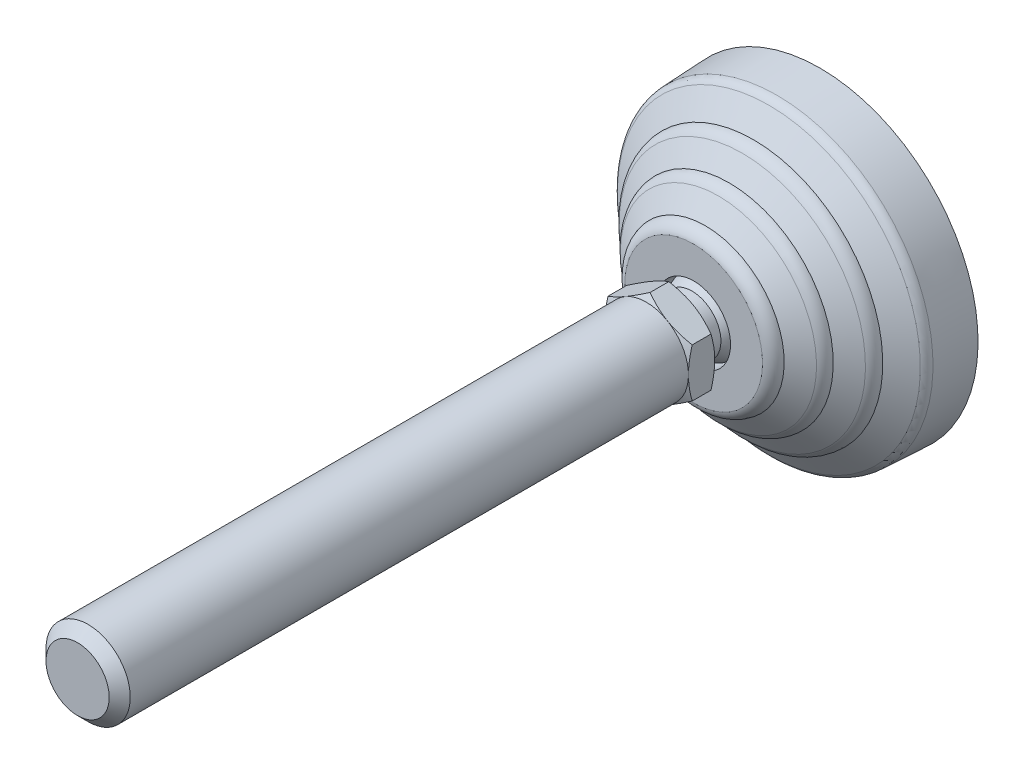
ISO-10303-21;
HEADER;
FILE_DESCRIPTION(('STEP AP214'),'2;1');
FILE_NAME('part.step','',(''),(''),'','','');
FILE_SCHEMA(('AUTOMOTIVE_DESIGN { 1 0 10303 214 1 1 1 1 }'));
ENDSEC;
DATA;
#1=APPLICATION_CONTEXT('core data for automotive mechanical design processes');
#2=APPLICATION_PROTOCOL_DEFINITION('international standard','automotive_design',2000,#1);
#3=PRODUCT_CONTEXT('',#1,'mechanical');
#4=PRODUCT('Part','Part','',(#3));
#5=PRODUCT_RELATED_PRODUCT_CATEGORY('part','',(#4));
#6=PRODUCT_DEFINITION_FORMATION('','',#4);
#7=PRODUCT_DEFINITION_CONTEXT('part definition',#1,'design');
#8=PRODUCT_DEFINITION('design','',#6,#7);
#9=PRODUCT_DEFINITION_SHAPE('','',#8);
#10=(LENGTH_UNIT() NAMED_UNIT(*) SI_UNIT(.MILLI.,.METRE.));
#11=(NAMED_UNIT(*) PLANE_ANGLE_UNIT() SI_UNIT($,.RADIAN.));
#12=(NAMED_UNIT(*) SI_UNIT($,.STERADIAN.) SOLID_ANGLE_UNIT());
#13=UNCERTAINTY_MEASURE_WITH_UNIT(LENGTH_MEASURE(1.E-05),#10,'distance_accuracy_value','');
#14=(GEOMETRIC_REPRESENTATION_CONTEXT(3) GLOBAL_UNCERTAINTY_ASSIGNED_CONTEXT((#13)) GLOBAL_UNIT_ASSIGNED_CONTEXT((#10,
#11,#12)) REPRESENTATION_CONTEXT('',''));
#15=CARTESIAN_POINT('',(0.,0.,0.));
#16=DIRECTION('',(0.,0.,1.));
#17=DIRECTION('',(1.,0.,0.));
#18=AXIS2_PLACEMENT_3D('',#15,#16,#17);
#19=CARTESIAN_POINT('',(0.,0.,85.773));
#20=DIRECTION('',(0.,0.,-1.));
#21=DIRECTION('',(0.,1.,0.));
#22=AXIS2_PLACEMENT_3D('',#19,#20,#21);
#23=CYLINDRICAL_SURFACE('',#22,8.);
#24=CARTESIAN_POINT('',(0.,0.,139.));
#25=DIRECTION('',(0.,0.,1.));
#26=DIRECTION('',(0.,-1.,0.));
#27=AXIS2_PLACEMENT_3D('',#24,#25,#26);
#28=CIRCLE('',#27,8.);
#29=CARTESIAN_POINT('',(0.,-8.,139.));
#30=VERTEX_POINT('',#29);
#31=EDGE_CURVE('E9',#30,#30,#28,.F.);
#32=ORIENTED_EDGE('',*,*,#31,.T.);
#33=EDGE_LOOP('',(#32));
#34=FACE_BOUND('',#33,.T.);
#35=CARTESIAN_POINT('',(0.,0.,33.));
#36=DIRECTION('',(0.,0.,-1.));
#37=DIRECTION('',(0.,1.,0.));
#38=AXIS2_PLACEMENT_3D('',#35,#36,#37);
#39=CIRCLE('',#38,8.);
#40=CARTESIAN_POINT('',(0.,8.,33.));
#41=VERTEX_POINT('',#40);
#42=EDGE_CURVE('E124',#41,#41,#39,.F.);
#43=ORIENTED_EDGE('',*,*,#42,.T.);
#44=EDGE_LOOP('',(#43));
#45=FACE_BOUND('',#44,.T.);
#46=ADVANCED_FACE('F14',(#34,#45),#23,.T.);
#47=CARTESIAN_POINT('',(7.995,0.,33.));
#48=DIRECTION('',(0.,0.,-1.));
#49=DIRECTION('',(0.,1.,0.));
#50=AXIS2_PLACEMENT_3D('',#47,#48,#49);
#51=PLANE('',#50);
#52=CARTESIAN_POINT('',(0.,0.,33.));
#53=DIRECTION('',(0.,0.,-1.));
#54=DIRECTION('',(0.,1.,0.));
#55=AXIS2_PLACEMENT_3D('',#52,#53,#54);
#56=CIRCLE('',#55,7.99);
#57=CARTESIAN_POINT('',(0.,7.99,33.));
#58=VERTEX_POINT('',#57);
#59=EDGE_CURVE('E132',#58,#58,#56,.F.);
#60=ORIENTED_EDGE('',*,*,#59,.T.);
#61=EDGE_LOOP('',(#60));
#62=FACE_BOUND('',#61,.T.);
#63=ORIENTED_EDGE('',*,*,#42,.F.);
#64=EDGE_LOOP('',(#63));
#65=FACE_BOUND('',#64,.T.);
#66=ADVANCED_FACE('F157',(#62,#65),#51,.T.);
#67=CARTESIAN_POINT('',(0.,0.,32.2753734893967));
#68=DIRECTION('',(0.,0.,-1.));
#69=DIRECTION('',(0.,1.,0.));
#70=AXIS2_PLACEMENT_3D('',#67,#68,#69);
#71=CONICAL_SURFACE('',#70,9.2450899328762,1.0471975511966);
#72=ORIENTED_EDGE('',*,*,#59,.F.);
#73=EDGE_LOOP('',(#72));
#74=FACE_BOUND('',#73,.T.);
#75=CARTESIAN_POINT('',(-4.19327851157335E-08,-9.23760428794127,32.2796952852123));
#76=CARTESIAN_POINT('',(0.175847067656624,-9.13607893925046,32.3382996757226));
#77=CARTESIAN_POINT('',(0.352349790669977,-9.03417505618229,32.3942441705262));
#78=CARTESIAN_POINT('',(0.706788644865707,-8.82953969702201,32.5000807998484));
#79=CARTESIAN_POINT('',(0.884725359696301,-8.72680788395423,32.5499703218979));
#80=CARTESIAN_POINT('',(1.42138431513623,-8.41696768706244,32.6895770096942));
#81=CARTESIAN_POINT('',(1.78222493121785,-8.20863626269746,32.7689823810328));
#82=CARTESIAN_POINT('',(2.32221590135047,-7.896872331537,32.862092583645));
#83=CARTESIAN_POINT('',(2.49975318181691,-7.79437113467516,32.8886165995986));
#84=CARTESIAN_POINT('',(2.85563052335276,-7.58890525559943,32.9330919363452));
#85=CARTESIAN_POINT('',(3.03397051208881,-7.48594061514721,32.9510440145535));
#86=CARTESIAN_POINT('',(3.3909574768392,-7.27983409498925,32.9779205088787));
#87=CARTESIAN_POINT('',(3.56960387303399,-7.17669255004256,32.9868551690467));
#88=CARTESIAN_POINT('',(3.92706158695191,-6.97031424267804,32.9955052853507));
#89=CARTESIAN_POINT('',(4.10587289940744,-6.86707748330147,32.995221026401));
#90=CARTESIAN_POINT('',(4.44015430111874,-6.67408002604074,32.9860752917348));
#91=CARTESIAN_POINT('',(4.59564800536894,-6.58430569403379,32.9783294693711));
#92=CARTESIAN_POINT('',(4.90627121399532,-6.4049673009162,32.956016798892));
#93=CARTESIAN_POINT('',(5.06140069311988,-6.31540325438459,32.9414494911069));
#94=CARTESIAN_POINT('',(5.52618852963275,-6.04705787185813,32.8878596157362));
#95=CARTESIAN_POINT('',(5.83502420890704,-5.86875150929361,32.8389557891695));
#96=CARTESIAN_POINT('',(6.45597113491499,-5.51024763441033,32.7166979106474));
#97=CARTESIAN_POINT('',(6.76800315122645,-5.33009586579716,32.6428257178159));
#98=CARTESIAN_POINT('',(7.38741452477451,-4.97247854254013,32.4751673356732));
#99=CARTESIAN_POINT('',(7.69480181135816,-4.79500840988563,32.3814205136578));
#100=CARTESIAN_POINT('',(7.9999999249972,-4.6188021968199,32.2796953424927));
#101=B_SPLINE_CURVE_WITH_KNOTS('',3,(#75,#76,#77,#78,#79,#80,#81,#82,#83,#84,#85,#86,#87,#88,
#89,#90,#91,#92,#93,#94,#95,#96,#97,#98,#99,#100),.UNSPECIFIED.,.F.,.F.,(4,2,2,2,2,2,2,2,2,2,2,
2,4),(0.,0.633965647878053,1.26820386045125,2.53931509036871,3.15930425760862,3.77923863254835,
4.39846794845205,5.01767812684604,5.55669080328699,6.09573980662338,7.17460542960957,
8.2773951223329,9.37802050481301),.UNSPECIFIED.);
#102=CARTESIAN_POINT('',(-1.44240227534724E-08,-9.23760431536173,32.2796953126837));
#103=VERTEX_POINT('',#102);
#104=CARTESIAN_POINT('',(8.,-4.61880217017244,32.2796953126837));
#105=VERTEX_POINT('',#104);
#106=EDGE_CURVE('E143',#103,#105,#101,.T.);
#107=ORIENTED_EDGE('',*,*,#106,.T.);
#108=CARTESIAN_POINT('',(7.9999999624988,-4.6188021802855,32.2796952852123));
#109=CARTESIAN_POINT('',(7.99999998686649,-4.23969380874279,32.3891659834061));
#110=CARTESIAN_POINT('',(7.999999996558,-3.85751175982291,32.4893813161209));
#111=CARTESIAN_POINT('',(8.00000000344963,-3.08693961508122,32.6664987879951));
#112=CARTESIAN_POINT('',(8.00000000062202,-2.69853763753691,32.7433487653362));
#113=CARTESIAN_POINT('',(7.99999999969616,-2.11699996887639,32.8364192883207));
#114=CARTESIAN_POINT('',(7.99999999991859,-1.92560834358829,32.8635449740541));
#115=CARTESIAN_POINT('',(8.0000000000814,-1.54193621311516,32.9104602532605));
#116=CARTESIAN_POINT('',(8.0000000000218,-1.34965578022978,32.9302504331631));
#117=CARTESIAN_POINT('',(7.99999999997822,-0.96464588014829,32.962068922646));
#118=CARTESIAN_POINT('',(7.99999999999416,-0.771917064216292,32.9741050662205));
#119=CARTESIAN_POINT('',(8.00000000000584,-0.386125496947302,32.9901838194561));
#120=CARTESIAN_POINT('',(8.00000000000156,-0.193062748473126,32.9942264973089));
#121=CARTESIAN_POINT('',(7.99999999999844,0.193062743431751,32.9942264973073));
#122=CARTESIAN_POINT('',(7.99999999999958,0.386125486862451,32.990183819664));
#123=CARTESIAN_POINT('',(8.00000000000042,0.771917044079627,32.9741050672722));
#124=CARTESIAN_POINT('',(8.00000000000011,0.96464585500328,32.962068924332));
#125=CARTESIAN_POINT('',(7.99999999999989,1.34965574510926,32.930250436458));
#126=CARTESIAN_POINT('',(7.99999999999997,1.54193617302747,32.9104602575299));
#127=CARTESIAN_POINT('',(8.00000000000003,1.92560829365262,32.8635449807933));
#128=CARTESIAN_POINT('',(8.00000000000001,2.11699991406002,32.8364192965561));
#129=CARTESIAN_POINT('',(7.99999999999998,2.69853756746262,32.7433487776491));
#130=CARTESIAN_POINT('',(7.99999999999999,3.0869395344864,32.6664988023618));
#131=CARTESIAN_POINT('',(8.00000000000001,3.85751166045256,32.4893813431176));
#132=CARTESIAN_POINT('',(8.00000000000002,4.23969370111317,32.3891660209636));
#133=CARTESIAN_POINT('',(8.,4.61880206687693,32.2796953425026));
#134=B_SPLINE_CURVE_WITH_KNOTS('',3,(#108,#109,#110,#111,#112,#113,#114,#115,#116,#117,#118,
#119,#120,#121,#122,#123,#124,#125,#126,#127,#128,#129,#130,#131,#132,#133),.UNSPECIFIED.,.F.,
.F.,(4,2,2,2,2,2,2,2,2,2,2,2,4),(0.,1.1842935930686,2.37121196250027,2.95099639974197,
3.53073447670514,4.10988591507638,4.68903241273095,5.26817889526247,5.84733031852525,
6.42706838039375,7.00685280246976,8.19377114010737,9.37806470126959),.UNSPECIFIED.);
#135=CARTESIAN_POINT('',(8.00000001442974,4.618802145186,32.2796953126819));
#136=VERTEX_POINT('',#135);
#137=EDGE_CURVE('E135',#105,#136,#134,.T.);
#138=ORIENTED_EDGE('',*,*,#137,.T.);
#139=CARTESIAN_POINT('',(8.00000000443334,4.61880210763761,32.2796952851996));
#140=CARTESIAN_POINT('',(7.82415291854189,4.72032749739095,32.3382996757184));
#141=CARTESIAN_POINT('',(7.64765020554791,4.8222313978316,32.3942441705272));
#142=CARTESIAN_POINT('',(7.29321135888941,5.02686677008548,32.500080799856));
#143=CARTESIAN_POINT('',(7.11527464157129,5.12959857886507,32.549970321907));
#144=CARTESIAN_POINT('',(6.57861568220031,5.43943876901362,32.689577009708));
#145=CARTESIAN_POINT('',(6.21777506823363,5.6477701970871,32.7689823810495));
#146=CARTESIAN_POINT('',(5.67778409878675,5.95953412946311,32.8620925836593));
#147=CARTESIAN_POINT('',(5.50024681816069,6.06203532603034,32.8886165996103));
#148=CARTESIAN_POINT('',(5.14436947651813,6.2675012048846,32.9330919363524));
#149=CARTESIAN_POINT('',(4.96602948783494,6.37046584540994,32.9510440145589));
#150=CARTESIAN_POINT('',(4.60904252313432,6.57657236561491,32.977920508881));
#151=CARTESIAN_POINT('',(4.43039612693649,6.6797139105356,32.986855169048));
#152=CARTESIAN_POINT('',(4.0729384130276,6.88609221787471,32.9955052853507));
#153=CARTESIAN_POINT('',(3.89412710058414,6.98932897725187,32.9952210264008));
#154=CARTESIAN_POINT('',(3.55984569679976,7.18232643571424,32.9860752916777));
#155=CARTESIAN_POINT('',(3.40435199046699,7.27210076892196,32.9783294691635));
#156=CARTESIAN_POINT('',(3.09372877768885,7.45143916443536,32.9560167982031));
#157=CARTESIAN_POINT('',(2.93859929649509,7.54100321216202,32.9414494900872));
#158=CARTESIAN_POINT('',(2.47381145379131,7.80934859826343,32.8878596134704));
#159=CARTESIAN_POINT('',(2.16497577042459,7.98765496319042,32.8389557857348));
#160=CARTESIAN_POINT('',(1.54402883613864,8.34615884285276,32.7166979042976));
#161=CARTESIAN_POINT('',(1.23199681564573,8.52631061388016,32.6428257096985));
#162=CARTESIAN_POINT('',(0.612585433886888,8.8839279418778,32.4751673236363));
#163=CARTESIAN_POINT('',(0.305198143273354,9.06139807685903,32.3814204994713));
#164=CARTESIAN_POINT('',(2.56600579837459E-08,9.23760429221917,32.2796953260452));
#165=B_SPLINE_CURVE_WITH_KNOTS('',3,(#139,#140,#141,#142,#143,#144,#145,#146,#147,#148,#149,
#150,#151,#152,#153,#154,#155,#156,#157,#158,#159,#160,#161,#162,#163,#164),.UNSPECIFIED.,.F.,
.F.,(4,2,2,2,2,2,2,2,2,2,2,2,4),(0.,0.633965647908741,1.26820386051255,2.53931509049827,
3.15930425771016,3.77923863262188,4.39846794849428,5.01767812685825,5.55669081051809,
6.09573982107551,7.1746054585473,8.27739516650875,9.37802056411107),.UNSPECIFIED.);
#166=CARTESIAN_POINT('',(-1.15386855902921E-08,9.23760430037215,32.279695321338));
#167=VERTEX_POINT('',#166);
#168=EDGE_CURVE('E181',#136,#167,#165,.T.);
#169=ORIENTED_EDGE('',*,*,#168,.T.);
#170=CARTESIAN_POINT('',(-1.65350876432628E-08,9.23760427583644,32.2796953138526));
#171=CARTESIAN_POINT('',(-0.175847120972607,9.13607891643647,32.3382996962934));
#172=CARTESIAN_POINT('',(-0.352349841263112,9.03417502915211,32.3942441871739));
#173=CARTESIAN_POINT('',(-0.706788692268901,8.82953966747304,32.5000808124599));
#174=CARTESIAN_POINT('',(-0.884725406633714,8.72680785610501,32.5499703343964));
#175=CARTESIAN_POINT('',(-1.42138436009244,8.41696766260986,32.6895770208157));
#176=CARTESIAN_POINT('',(-1.78222497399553,8.20863623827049,32.7689823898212));
#177=CARTESIAN_POINT('',(-2.32221594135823,7.89687230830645,32.8620925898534));
#178=CARTESIAN_POINT('',(-2.4997532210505,7.79437111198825,32.8886166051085));
#179=CARTESIAN_POINT('',(-2.85563056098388,7.58890523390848,32.9330919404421));
#180=CARTESIAN_POINT('',(-3.03397054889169,7.48594059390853,32.9510440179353));
#181=CARTESIAN_POINT('',(-3.39095751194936,7.27983407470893,32.9779205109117));
#182=CARTESIAN_POINT('',(-3.56960390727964,7.1766925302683,32.9868551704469));
#183=CARTESIAN_POINT('',(-3.92706161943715,6.97031422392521,32.9955052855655));
#184=CARTESIAN_POINT('',(-4.10587293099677,6.867077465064,32.9952210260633));
#185=CARTESIAN_POINT('',(-4.44015433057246,6.67408000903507,32.9860752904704));
#186=CARTESIAN_POINT('',(-4.59564803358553,6.58430567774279,32.9783294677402));
#187=CARTESIAN_POINT('',(-4.90627123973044,6.40496728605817,32.9560167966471));
#188=CARTESIAN_POINT('',(-5.06140071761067,6.31540324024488,32.9414494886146));
#189=CARTESIAN_POINT('',(-5.52618855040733,6.04705785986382,32.8878596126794));
#190=CARTESIAN_POINT('',(-5.83502422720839,5.8687514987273,32.8389557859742));
#191=CARTESIAN_POINT('',(-6.45597114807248,5.51024762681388,32.7166979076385));
#192=CARTESIAN_POINT('',(-6.76800316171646,5.33009585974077,32.6428257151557));
#193=CARTESIAN_POINT('',(-7.38741452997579,4.97247853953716,32.4751673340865));
#194=CARTESIAN_POINT('',(-7.69480181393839,4.7950084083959,32.381420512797));
#195=CARTESIAN_POINT('',(-7.9999999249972,4.6188021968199,32.2796953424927));
#196=B_SPLINE_CURVE_WITH_KNOTS('',3,(#170,#171,#172,#173,#174,#175,#176,#177,#178,#179,#180,
#181,#182,#183,#184,#185,#186,#187,#188,#189,#190,#191,#192,#193,#194,#195),.UNSPECIFIED.,.F.,
.F.,(4,2,2,2,2,2,2,2,2,2,2,2,4),(0.,0.633965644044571,1.26820385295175,2.5393150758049,
3.15930423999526,3.77923861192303,4.39846792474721,5.01767810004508,5.55669077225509,
6.09573977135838,7.17460538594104,8.27739506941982,9.37802044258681),.UNSPECIFIED.);
#197=CARTESIAN_POINT('',(-8.,4.61880217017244,32.2796953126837));
#198=VERTEX_POINT('',#197);
#199=EDGE_CURVE('E173',#167,#198,#196,.T.);
#200=ORIENTED_EDGE('',*,*,#199,.T.);
#201=CARTESIAN_POINT('',(-7.9999999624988,4.6188021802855,32.2796952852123));
#202=CARTESIAN_POINT('',(-7.99999998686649,4.23969380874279,32.3891659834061));
#203=CARTESIAN_POINT('',(-7.999999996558,3.85751175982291,32.4893813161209));
#204=CARTESIAN_POINT('',(-8.00000000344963,3.08693961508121,32.6664987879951));
#205=CARTESIAN_POINT('',(-8.00000000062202,2.69853763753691,32.7433487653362));
#206=CARTESIAN_POINT('',(-7.99999999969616,2.11699996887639,32.8364192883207));
#207=CARTESIAN_POINT('',(-7.99999999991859,1.92560834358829,32.8635449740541));
#208=CARTESIAN_POINT('',(-8.0000000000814,1.54193621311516,32.9104602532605));
#209=CARTESIAN_POINT('',(-8.0000000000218,1.34965578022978,32.9302504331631));
#210=CARTESIAN_POINT('',(-7.99999999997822,0.964645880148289,32.962068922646));
#211=CARTESIAN_POINT('',(-7.99999999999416,0.77191706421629,32.9741050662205));
#212=CARTESIAN_POINT('',(-8.00000000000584,0.386125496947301,32.9901838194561));
#213=CARTESIAN_POINT('',(-8.00000000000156,0.193062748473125,32.9942264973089));
#214=CARTESIAN_POINT('',(-7.99999999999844,-0.193062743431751,32.9942264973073));
#215=CARTESIAN_POINT('',(-7.99999999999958,-0.386125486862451,32.990183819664));
#216=CARTESIAN_POINT('',(-8.00000000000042,-0.771917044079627,32.9741050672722));
#217=CARTESIAN_POINT('',(-8.00000000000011,-0.96464585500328,32.962068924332));
#218=CARTESIAN_POINT('',(-7.99999999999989,-1.34965574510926,32.930250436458));
#219=CARTESIAN_POINT('',(-7.99999999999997,-1.54193617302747,32.9104602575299));
#220=CARTESIAN_POINT('',(-8.00000000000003,-1.92560829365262,32.8635449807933));
#221=CARTESIAN_POINT('',(-8.00000000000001,-2.11699991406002,32.8364192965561));
#222=CARTESIAN_POINT('',(-7.99999999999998,-2.69853756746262,32.7433487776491));
#223=CARTESIAN_POINT('',(-7.99999999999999,-3.0869395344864,32.6664988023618));
#224=CARTESIAN_POINT('',(-8.00000000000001,-3.85751166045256,32.4893813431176));
#225=CARTESIAN_POINT('',(-8.00000000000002,-4.23969370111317,32.3891660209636));
#226=CARTESIAN_POINT('',(-8.,-4.61880206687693,32.2796953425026));
#227=B_SPLINE_CURVE_WITH_KNOTS('',3,(#201,#202,#203,#204,#205,#206,#207,#208,#209,#210,#211,
#212,#213,#214,#215,#216,#217,#218,#219,#220,#221,#222,#223,#224,#225,#226),.UNSPECIFIED.,.F.,
.F.,(4,2,2,2,2,2,2,2,2,2,2,2,4),(0.,1.18429359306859,2.37121196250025,2.95099639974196,
3.53073447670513,4.10988591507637,4.68903241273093,5.26817889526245,5.84733031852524,
6.42706838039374,7.00685280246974,8.19377114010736,9.37806470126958),.UNSPECIFIED.);
#228=CARTESIAN_POINT('',(-8.00000001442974,-4.61880214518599,32.2796953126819));
#229=VERTEX_POINT('',#228);
#230=EDGE_CURVE('E342',#198,#229,#227,.T.);
#231=ORIENTED_EDGE('',*,*,#230,.T.);
#232=CARTESIAN_POINT('',(-8.00000000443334,-4.61880210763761,32.2796952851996));
#233=CARTESIAN_POINT('',(-7.82415291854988,-4.72032749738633,32.3382996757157));
#234=CARTESIAN_POINT('',(-7.64765020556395,-4.82223139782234,32.3942441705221));
#235=CARTESIAN_POINT('',(-7.29321135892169,-5.02686677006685,32.5000807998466));
#236=CARTESIAN_POINT('',(-7.11527464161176,-5.1295985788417,32.5499703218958));
#237=CARTESIAN_POINT('',(-6.57861568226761,-5.43943876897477,32.6895770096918));
#238=CARTESIAN_POINT('',(-6.21777506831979,-5.64777019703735,32.7689823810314));
#239=CARTESIAN_POINT('',(-5.67778409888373,-5.95953412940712,32.8620925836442));
#240=CARTESIAN_POINT('',(-5.50024681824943,-6.06203532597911,32.8886165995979));
#241=CARTESIAN_POINT('',(-5.14436947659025,-6.26750120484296,32.9330919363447));
#242=CARTESIAN_POINT('',(-4.96602948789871,-6.37046584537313,32.9510440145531));
#243=CARTESIAN_POINT('',(-4.60904252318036,-6.57657236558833,32.9779205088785));
#244=CARTESIAN_POINT('',(-4.43039612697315,-6.67971391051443,32.9868551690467));
#245=CARTESIAN_POINT('',(-4.0729384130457,-6.88609221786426,32.9955052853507));
#246=CARTESIAN_POINT('',(-3.89412710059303,-6.98932897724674,32.995221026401));
#247=CARTESIAN_POINT('',(-3.55984569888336,-7.18232643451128,32.9860752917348));
#248=CARTESIAN_POINT('',(-3.40435199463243,-7.27210076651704,32.9783294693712));
#249=CARTESIAN_POINT('',(-3.09372878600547,-7.45143915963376,32.9560167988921));
#250=CARTESIAN_POINT('',(-2.93859930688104,-7.54100320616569,32.941449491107));
#251=CARTESIAN_POINT('',(-2.47381147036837,-7.80934858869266,32.8878596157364));
#252=CARTESIAN_POINT('',(-2.16497579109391,-7.98765495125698,32.8389557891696));
#253=CARTESIAN_POINT('',(-1.54402886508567,-8.34615882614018,32.7166979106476));
#254=CARTESIAN_POINT('',(-1.2319968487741,-8.52631059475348,32.642825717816));
#255=CARTESIAN_POINT('',(-0.612585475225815,-8.88392791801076,32.4751673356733));
#256=CARTESIAN_POINT('',(-0.305198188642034,-9.06139805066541,32.3814205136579));
#257=CARTESIAN_POINT('',(-7.50027841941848E-08,-9.23760426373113,32.2796953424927));
#258=B_SPLINE_CURVE_WITH_KNOTS('',3,(#232,#233,#234,#235,#236,#237,#238,#239,#240,#241,#242,
#243,#244,#245,#246,#247,#248,#249,#250,#251,#252,#253,#254,#255,#256,#257),.UNSPECIFIED.,.F.,
.F.,(4,2,2,2,2,2,2,2,2,2,2,2,4),(0.,0.633965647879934,1.26820386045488,2.53931509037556,
3.15930425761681,3.77923863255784,4.39846794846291,5.01767812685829,5.55669080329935,
6.09573980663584,7.17460542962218,8.27739512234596,9.37802050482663),.UNSPECIFIED.);
#259=EDGE_CURVE('E163',#229,#103,#258,.T.);
#260=ORIENTED_EDGE('',*,*,#259,.T.);
#261=EDGE_LOOP('',(#107,#138,#169,#200,#231,#260));
#262=FACE_BOUND('',#261,.T.);
#263=ADVANCED_FACE('F152',(#74,#262),#71,.T.);
#264=CARTESIAN_POINT('',(0.,-9.23760430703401,33.1));
#265=DIRECTION('',(0.5,0.866025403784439,0.));
#266=DIRECTION('',(-0.866025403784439,0.5,0.));
#267=AXIS2_PLACEMENT_3D('',#264,#265,#266);
#268=PLANE('',#267);
#269=DIRECTION('',(0.,0.,1.));
#270=VECTOR('',#269,1.);
#271=CARTESIAN_POINT('',(0.,-9.23760430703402,33.1));
#272=LINE('',#271,#270);
#273=CARTESIAN_POINT('',(0.,-9.23760430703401,28.7203046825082));
#274=VERTEX_POINT('',#273);
#275=EDGE_CURVE('E368',#274,#103,#272,.T.);
#276=ORIENTED_EDGE('',*,*,#275,.T.);
#277=ORIENTED_EDGE('',*,*,#259,.F.);
#278=DIRECTION('',(0.,0.,1.));
#279=VECTOR('',#278,1.);
#280=CARTESIAN_POINT('',(-8.,-4.61880215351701,33.1));
#281=LINE('',#280,#279);
#282=CARTESIAN_POINT('',(-8.,-4.61880215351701,28.7203046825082));
#283=VERTEX_POINT('',#282);
#284=EDGE_CURVE('E360',#283,#229,#281,.T.);
#285=ORIENTED_EDGE('',*,*,#284,.F.);
#286=CARTESIAN_POINT('',(0.,-9.23760430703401,28.7203046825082));
#287=CARTESIAN_POINT('',(-0.175847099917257,-9.13607893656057,28.6617003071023));
#288=CARTESIAN_POINT('',(-0.35234981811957,-9.03417504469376,28.6057558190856));
#289=CARTESIAN_POINT('',(-0.706788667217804,-8.82953967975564,28.4999191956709));
#290=CARTESIAN_POINT('',(-0.884725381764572,-8.72680786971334,28.4500296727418));
#291=CARTESIAN_POINT('',(-1.42138433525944,-8.41696767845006,28.3104229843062));
#292=CARTESIAN_POINT('',(-1.78222494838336,-8.20863625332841,28.2310176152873));
#293=CARTESIAN_POINT('',(-2.32221591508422,-7.89687232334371,28.1379074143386));
#294=CARTESIAN_POINT('',(-2.49975319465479,-7.79437112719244,28.1113833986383));
#295=CARTESIAN_POINT('',(-2.8556305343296,-7.5889052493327,28.0669080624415));
#296=CARTESIAN_POINT('',(-3.03397052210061,-7.48594060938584,28.0489559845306));
#297=CARTESIAN_POINT('',(-3.3909574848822,-7.2798340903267,28.0220794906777));
#298=CARTESIAN_POINT('',(-3.56960388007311,-7.17669254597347,28.0131448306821));
#299=CARTESIAN_POINT('',(-3.9270615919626,-6.97031423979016,28.0044947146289));
#300=CARTESIAN_POINT('',(-4.10587290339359,-6.86707748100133,28.0047789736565));
#301=CARTESIAN_POINT('',(-4.44015430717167,-6.67408002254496,28.0139247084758));
#302=CARTESIAN_POINT('',(-4.59564801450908,-6.58430568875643,28.0216705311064));
#303=CARTESIAN_POINT('',(-4.90627122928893,-6.40496729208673,28.0439832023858));
#304=CARTESIAN_POINT('',(-5.06140071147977,-6.3154032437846,28.0585505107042));
#305=CARTESIAN_POINT('',(-5.52618855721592,-6.04705785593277,28.1121403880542));
#306=CARTESIAN_POINT('',(-5.83502424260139,-5.86875148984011,28.161044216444));
#307=CARTESIAN_POINT('',(-6.45597118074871,-5.51024760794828,28.2833020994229));
#308=CARTESIAN_POINT('',(-6.76800320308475,-5.33009583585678,28.3571742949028));
#309=CARTESIAN_POINT('',(-7.38741458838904,-4.97247850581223,28.5248326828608));
#310=CARTESIAN_POINT('',(-7.69480188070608,-4.79500836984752,28.6185795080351));
#311=CARTESIAN_POINT('',(-8.,-4.61880215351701,28.7203046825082));
#312=B_SPLINE_CURVE_WITH_KNOTS('',3,(#286,#287,#288,#289,#290,#291,#292,#293,#294,#295,#296,
#297,#298,#299,#300,#301,#302,#303,#304,#305,#306,#307,#308,#309,#310,#311),.UNSPECIFIED.,.F.,
.F.,(4,2,2,2,2,2,2,2,2,2,2,2,4),(0.,0.633965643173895,1.26820385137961,2.53931507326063,
3.15930423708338,3.77923860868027,4.3984679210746,5.01767809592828,5.55669078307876,
6.0957397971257,7.17460544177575,8.27739515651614,9.37802056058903),.UNSPECIFIED.);
#313=EDGE_CURVE('E362',#274,#283,#312,.T.);
#314=ORIENTED_EDGE('',*,*,#313,.F.);
#315=EDGE_LOOP('',(#276,#277,#285,#314));
#316=FACE_BOUND('',#315,.T.);
#317=ADVANCED_FACE('F156',(#316),#268,.F.);
#318=CARTESIAN_POINT('',(8.,-4.61880215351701,33.1));
#319=DIRECTION('',(-0.5,0.866025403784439,0.));
#320=DIRECTION('',(-0.866025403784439,-0.5,0.));
#321=AXIS2_PLACEMENT_3D('',#318,#319,#320);
#322=PLANE('',#321);
#323=DIRECTION('',(0.,0.,1.));
#324=VECTOR('',#323,1.);
#325=CARTESIAN_POINT('',(8.,-4.61880215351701,33.1));
#326=LINE('',#325,#324);
#327=CARTESIAN_POINT('',(8.,-4.61880215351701,28.7203046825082));
#328=VERTEX_POINT('',#327);
#329=EDGE_CURVE('E31',#328,#105,#326,.T.);
#330=ORIENTED_EDGE('',*,*,#329,.T.);
#331=ORIENTED_EDGE('',*,*,#106,.F.);
#332=ORIENTED_EDGE('',*,*,#275,.F.);
#333=CARTESIAN_POINT('',(8.,-4.61880215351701,28.7203046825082));
#334=CARTESIAN_POINT('',(7.82415290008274,-4.72032752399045,28.6617003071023));
#335=CARTESIAN_POINT('',(7.64765018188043,-4.82223141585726,28.6057558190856));
#336=CARTESIAN_POINT('',(7.2932113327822,-5.02686678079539,28.4999191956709));
#337=CARTESIAN_POINT('',(7.11527461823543,-5.12959859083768,28.4500296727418));
#338=CARTESIAN_POINT('',(6.57861566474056,-5.43943878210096,28.3104229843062));
#339=CARTESIAN_POINT('',(6.21777505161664,-5.64777020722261,28.2310176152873));
#340=CARTESIAN_POINT('',(5.67778408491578,-5.95953413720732,28.1379074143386));
#341=CARTESIAN_POINT('',(5.50024680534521,-6.06203533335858,28.1113833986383));
#342=CARTESIAN_POINT('',(5.14436946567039,-6.26750121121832,28.0669080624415));
#343=CARTESIAN_POINT('',(4.96602947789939,-6.37046585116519,28.0489559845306));
#344=CARTESIAN_POINT('',(4.60904251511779,-6.57657237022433,28.0220794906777));
#345=CARTESIAN_POINT('',(4.43039611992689,-6.67971391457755,28.0131448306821));
#346=CARTESIAN_POINT('',(4.0729384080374,-6.88609222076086,28.0044947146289));
#347=CARTESIAN_POINT('',(3.89412709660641,-6.98932897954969,28.0047789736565));
#348=CARTESIAN_POINT('',(3.55984569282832,-7.18232643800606,28.0139247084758));
#349=CARTESIAN_POINT('',(3.40435198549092,-7.2721007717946,28.0216705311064));
#350=CARTESIAN_POINT('',(3.09372877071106,-7.45143916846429,28.0439832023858));
#351=CARTESIAN_POINT('',(2.93859928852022,-7.54100321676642,28.0585505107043));
#352=CARTESIAN_POINT('',(2.47381144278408,-7.80934860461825,28.1121403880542));
#353=CARTESIAN_POINT('',(2.16497575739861,-7.98765497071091,28.161044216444));
#354=CARTESIAN_POINT('',(1.54402881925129,-8.34615885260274,28.2833020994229));
#355=CARTESIAN_POINT('',(1.23199679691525,-8.52631062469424,28.3571742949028));
#356=CARTESIAN_POINT('',(0.612585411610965,-8.88392795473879,28.5248326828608));
#357=CARTESIAN_POINT('',(0.305198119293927,-9.0613980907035,28.6185795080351));
#358=CARTESIAN_POINT('',(0.,-9.23760430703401,28.7203046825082));
#359=B_SPLINE_CURVE_WITH_KNOTS('',3,(#333,#334,#335,#336,#337,#338,#339,#340,#341,#342,#343,
#344,#345,#346,#347,#348,#349,#350,#351,#352,#353,#354,#355,#356,#357,#358),.UNSPECIFIED.,.F.,
.F.,(4,2,2,2,2,2,2,2,2,2,2,2,4),(0.,0.633965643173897,1.26820385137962,2.53931507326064,
3.15930423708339,3.77923860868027,4.39846792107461,5.01767809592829,5.55669078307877,
6.09573979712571,7.17460544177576,8.27739515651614,9.37802056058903),.UNSPECIFIED.);
#360=EDGE_CURVE('E369',#328,#274,#359,.T.);
#361=ORIENTED_EDGE('',*,*,#360,.F.);
#362=EDGE_LOOP('',(#330,#331,#332,#361));
#363=FACE_BOUND('',#362,.T.);
#364=ADVANCED_FACE('F375',(#363),#322,.F.);
#365=CARTESIAN_POINT('',(-8.,4.61880215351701,33.1));
#366=DIRECTION('',(0.5,-0.866025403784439,0.));
#367=DIRECTION('',(0.866025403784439,0.5,0.));
#368=AXIS2_PLACEMENT_3D('',#365,#366,#367);
#369=PLANE('',#368);
#370=DIRECTION('',(0.,0.,1.));
#371=VECTOR('',#370,1.);
#372=CARTESIAN_POINT('',(-8.,4.61880215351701,33.1));
#373=LINE('',#372,#371);
#374=CARTESIAN_POINT('',(-8.,4.61880215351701,28.7203046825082));
#375=VERTEX_POINT('',#374);
#376=EDGE_CURVE('E361',#375,#198,#373,.T.);
#377=ORIENTED_EDGE('',*,*,#376,.T.);
#378=ORIENTED_EDGE('',*,*,#199,.F.);
#379=DIRECTION('',(0.,0.,1.));
#380=VECTOR('',#379,1.);
#381=CARTESIAN_POINT('',(0.,9.23760430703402,33.1));
#382=LINE('',#381,#380);
#383=CARTESIAN_POINT('',(0.,9.23760430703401,28.7203046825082));
#384=VERTEX_POINT('',#383);
#385=EDGE_CURVE('E212',#384,#167,#382,.T.);
#386=ORIENTED_EDGE('',*,*,#385,.F.);
#387=CARTESIAN_POINT('',(-8.,4.61880215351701,28.7203046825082));
#388=CARTESIAN_POINT('',(-7.82415290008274,4.72032752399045,28.6617003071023));
#389=CARTESIAN_POINT('',(-7.64765018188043,4.82223141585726,28.6057558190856));
#390=CARTESIAN_POINT('',(-7.2932113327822,5.02686678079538,28.4999191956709));
#391=CARTESIAN_POINT('',(-7.11527461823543,5.12959859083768,28.4500296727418));
#392=CARTESIAN_POINT('',(-6.57861566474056,5.43943878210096,28.3104229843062));
#393=CARTESIAN_POINT('',(-6.21777505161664,5.64777020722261,28.2310176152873));
#394=CARTESIAN_POINT('',(-5.67778408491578,5.95953413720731,28.1379074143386));
#395=CARTESIAN_POINT('',(-5.50024680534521,6.06203533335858,28.1113833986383));
#396=CARTESIAN_POINT('',(-5.1443694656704,6.26750121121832,28.0669080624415));
#397=CARTESIAN_POINT('',(-4.96602947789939,6.37046585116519,28.0489559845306));
#398=CARTESIAN_POINT('',(-4.60904251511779,6.57657237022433,28.0220794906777));
#399=CARTESIAN_POINT('',(-4.43039611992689,6.67971391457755,28.0131448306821));
#400=CARTESIAN_POINT('',(-4.0729384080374,6.88609222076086,28.0044947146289));
#401=CARTESIAN_POINT('',(-3.89412709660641,6.98932897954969,28.0047789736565));
#402=CARTESIAN_POINT('',(-3.55984569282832,7.18232643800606,28.0139247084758));
#403=CARTESIAN_POINT('',(-3.40435198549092,7.2721007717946,28.0216705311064));
#404=CARTESIAN_POINT('',(-3.09372877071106,7.45143916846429,28.0439832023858));
#405=CARTESIAN_POINT('',(-2.93859928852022,7.54100321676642,28.0585505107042));
#406=CARTESIAN_POINT('',(-2.47381144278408,7.80934860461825,28.1121403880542));
#407=CARTESIAN_POINT('',(-2.16497575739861,7.98765497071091,28.161044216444));
#408=CARTESIAN_POINT('',(-1.54402881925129,8.34615885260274,28.2833020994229));
#409=CARTESIAN_POINT('',(-1.23199679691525,8.52631062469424,28.3571742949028));
#410=CARTESIAN_POINT('',(-0.612585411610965,8.88392795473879,28.5248326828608));
#411=CARTESIAN_POINT('',(-0.305198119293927,9.0613980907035,28.6185795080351));
#412=CARTESIAN_POINT('',(0.,9.23760430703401,28.7203046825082));
#413=B_SPLINE_CURVE_WITH_KNOTS('',3,(#387,#388,#389,#390,#391,#392,#393,#394,#395,#396,#397,
#398,#399,#400,#401,#402,#403,#404,#405,#406,#407,#408,#409,#410,#411,#412),.UNSPECIFIED.,.F.,
.F.,(4,2,2,2,2,2,2,2,2,2,2,2,4),(0.,0.633965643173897,1.26820385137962,2.53931507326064,
3.15930423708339,3.77923860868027,4.39846792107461,5.01767809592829,5.55669078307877,
6.09573979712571,7.17460544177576,8.27739515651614,9.37802056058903),.UNSPECIFIED.);
#414=EDGE_CURVE('E214',#375,#384,#413,.T.);
#415=ORIENTED_EDGE('',*,*,#414,.F.);
#416=EDGE_LOOP('',(#377,#378,#386,#415));
#417=FACE_BOUND('',#416,.T.);
#418=ADVANCED_FACE('F200',(#417),#369,.F.);
#419=CARTESIAN_POINT('',(-8.,-4.61880215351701,33.1));
#420=DIRECTION('',(1.,0.,0.));
#421=DIRECTION('',(0.,1.,0.));
#422=AXIS2_PLACEMENT_3D('',#419,#420,#421);
#423=PLANE('',#422);
#424=ORIENTED_EDGE('',*,*,#284,.T.);
#425=ORIENTED_EDGE('',*,*,#230,.F.);
#426=ORIENTED_EDGE('',*,*,#376,.F.);
#427=CARTESIAN_POINT('',(-8.,-4.618802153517,28.7203046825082));
#428=CARTESIAN_POINT('',(-8.,-4.23969378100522,28.6108340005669));
#429=CARTESIAN_POINT('',(-8.,-3.85751173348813,28.5106186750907));
#430=CARTESIAN_POINT('',(-8.,-3.08693959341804,28.333501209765));
#431=CARTESIAN_POINT('',(-8.,-2.69853761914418,28.2566512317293));
#432=CARTESIAN_POINT('',(-8.,-2.11699995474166,28.163580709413));
#433=CARTESIAN_POINT('',(-8.,-1.9256083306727,28.1364550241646));
#434=CARTESIAN_POINT('',(-8.,-1.54193620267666,28.0895397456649));
#435=CARTESIAN_POINT('',(-8.,-1.34965577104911,28.0697495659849));
#436=CARTESIAN_POINT('',(-8.,-0.964645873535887,28.0379310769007));
#437=CARTESIAN_POINT('',(-8.,-0.771917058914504,28.0258949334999));
#438=CARTESIAN_POINT('',(-8.,-0.38612549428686,28.0098161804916));
#439=CARTESIAN_POINT('',(-8.,-0.19306274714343,28.0057735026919));
#440=CARTESIAN_POINT('',(-8.,0.19306274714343,28.0057735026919));
#441=CARTESIAN_POINT('',(-8.,0.38612549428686,28.0098161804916));
#442=CARTESIAN_POINT('',(-8.,0.771917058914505,28.0258949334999));
#443=CARTESIAN_POINT('',(-8.,0.964645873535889,28.0379310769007));
#444=CARTESIAN_POINT('',(-8.,1.34965577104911,28.0697495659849));
#445=CARTESIAN_POINT('',(-8.,1.54193620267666,28.0895397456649));
#446=CARTESIAN_POINT('',(-8.,1.9256083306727,28.1364550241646));
#447=CARTESIAN_POINT('',(-8.,2.11699995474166,28.163580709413));
#448=CARTESIAN_POINT('',(-8.,2.69853761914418,28.2566512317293));
#449=CARTESIAN_POINT('',(-8.,3.08693959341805,28.333501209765));
#450=CARTESIAN_POINT('',(-8.,3.85751173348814,28.5106186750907));
#451=CARTESIAN_POINT('',(-8.,4.23969378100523,28.6108340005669));
#452=CARTESIAN_POINT('',(-8.,4.61880215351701,28.7203046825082));
#453=B_SPLINE_CURVE_WITH_KNOTS('',3,(#427,#428,#429,#430,#431,#432,#433,#434,#435,#436,#437,
#438,#439,#440,#441,#442,#443,#444,#445,#446,#447,#448,#449,#450,#451,#452),.UNSPECIFIED.,.F.,
.F.,(4,2,2,2,2,2,2,2,2,2,2,2,4),(0.,1.18429358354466,2.37121194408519,2.95099637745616,
3.53073445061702,4.10988588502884,4.68903237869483,5.26817887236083,5.84733030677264,
6.42706837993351,7.00685281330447,8.19377117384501,9.37806475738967),.UNSPECIFIED.);
#454=EDGE_CURVE('E354',#283,#375,#453,.T.);
#455=ORIENTED_EDGE('',*,*,#454,.F.);
#456=EDGE_LOOP('',(#424,#425,#426,#455));
#457=FACE_BOUND('',#456,.T.);
#458=ADVANCED_FACE('F348',(#457),#423,.F.);
#459=CARTESIAN_POINT('',(8.,4.61880215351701,33.1));
#460=DIRECTION('',(-1.,0.,0.));
#461=DIRECTION('',(0.,-1.,0.));
#462=AXIS2_PLACEMENT_3D('',#459,#460,#461);
#463=PLANE('',#462);
#464=DIRECTION('',(0.,0.,1.));
#465=VECTOR('',#464,1.);
#466=CARTESIAN_POINT('',(8.,4.61880215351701,33.1));
#467=LINE('',#466,#465);
#468=CARTESIAN_POINT('',(8.,4.61880215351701,28.7203046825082));
#469=VERTEX_POINT('',#468);
#470=EDGE_CURVE('E402',#136,#469,#467,.F.);
#471=ORIENTED_EDGE('',*,*,#470,.F.);
#472=ORIENTED_EDGE('',*,*,#137,.F.);
#473=ORIENTED_EDGE('',*,*,#329,.F.);
#474=CARTESIAN_POINT('',(8.,4.618802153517,28.7203046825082));
#475=CARTESIAN_POINT('',(8.,4.23969378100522,28.6108340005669));
#476=CARTESIAN_POINT('',(8.,3.85751173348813,28.5106186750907));
#477=CARTESIAN_POINT('',(8.,3.08693959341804,28.333501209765));
#478=CARTESIAN_POINT('',(8.,2.69853761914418,28.2566512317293));
#479=CARTESIAN_POINT('',(8.,2.11699995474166,28.163580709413));
#480=CARTESIAN_POINT('',(8.,1.9256083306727,28.1364550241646));
#481=CARTESIAN_POINT('',(8.,1.54193620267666,28.0895397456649));
#482=CARTESIAN_POINT('',(8.,1.34965577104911,28.0697495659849));
#483=CARTESIAN_POINT('',(8.,0.964645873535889,28.0379310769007));
#484=CARTESIAN_POINT('',(8.,0.771917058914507,28.0258949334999));
#485=CARTESIAN_POINT('',(8.,0.386125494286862,28.0098161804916));
#486=CARTESIAN_POINT('',(8.,0.193062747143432,28.0057735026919));
#487=CARTESIAN_POINT('',(8.,-0.193062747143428,28.0057735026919));
#488=CARTESIAN_POINT('',(8.,-0.386125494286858,28.0098161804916));
#489=CARTESIAN_POINT('',(8.,-0.771917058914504,28.0258949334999));
#490=CARTESIAN_POINT('',(8.,-0.964645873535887,28.0379310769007));
#491=CARTESIAN_POINT('',(8.,-1.34965577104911,28.0697495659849));
#492=CARTESIAN_POINT('',(8.,-1.54193620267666,28.0895397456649));
#493=CARTESIAN_POINT('',(8.,-1.9256083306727,28.1364550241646));
#494=CARTESIAN_POINT('',(8.,-2.11699995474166,28.163580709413));
#495=CARTESIAN_POINT('',(8.,-2.69853761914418,28.2566512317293));
#496=CARTESIAN_POINT('',(8.,-3.08693959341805,28.333501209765));
#497=CARTESIAN_POINT('',(8.,-3.85751173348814,28.5106186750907));
#498=CARTESIAN_POINT('',(8.,-4.23969378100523,28.6108340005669));
#499=CARTESIAN_POINT('',(8.,-4.61880215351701,28.7203046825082));
#500=B_SPLINE_CURVE_WITH_KNOTS('',3,(#474,#475,#476,#477,#478,#479,#480,#481,#482,#483,#484,
#485,#486,#487,#488,#489,#490,#491,#492,#493,#494,#495,#496,#497,#498,#499),.UNSPECIFIED.,.F.,
.F.,(4,2,2,2,2,2,2,2,2,2,2,2,4),(0.,1.18429358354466,2.37121194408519,2.95099637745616,
3.53073445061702,4.10988588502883,4.68903237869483,5.26817887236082,5.84733030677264,
6.4270683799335,7.00685281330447,8.19377117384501,9.37806475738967),.UNSPECIFIED.);
#501=EDGE_CURVE('E189',#469,#328,#500,.T.);
#502=ORIENTED_EDGE('',*,*,#501,.F.);
#503=EDGE_LOOP('',(#471,#472,#473,#502));
#504=FACE_BOUND('',#503,.T.);
#505=ADVANCED_FACE('F150',(#504),#463,.F.);
#506=CARTESIAN_POINT('',(0.,9.23760430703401,33.1));
#507=DIRECTION('',(-0.5,-0.866025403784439,0.));
#508=DIRECTION('',(0.866025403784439,-0.5,0.));
#509=AXIS2_PLACEMENT_3D('',#506,#507,#508);
#510=PLANE('',#509);
#511=ORIENTED_EDGE('',*,*,#385,.T.);
#512=ORIENTED_EDGE('',*,*,#168,.F.);
#513=ORIENTED_EDGE('',*,*,#470,.T.);
#514=CARTESIAN_POINT('',(0.,9.23760430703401,28.7203046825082));
#515=CARTESIAN_POINT('',(0.175847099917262,9.13607893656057,28.6617003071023));
#516=CARTESIAN_POINT('',(0.352349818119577,9.03417504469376,28.6057558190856));
#517=CARTESIAN_POINT('',(0.706788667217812,8.82953967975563,28.4999191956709));
#518=CARTESIAN_POINT('',(0.884725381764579,8.72680786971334,28.4500296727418));
#519=CARTESIAN_POINT('',(1.42138433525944,8.41696767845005,28.3104229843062));
#520=CARTESIAN_POINT('',(1.78222494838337,8.20863625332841,28.2310176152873));
#521=CARTESIAN_POINT('',(2.32221591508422,7.8968723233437,28.1379074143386));
#522=CARTESIAN_POINT('',(2.49975319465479,7.79437112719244,28.1113833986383));
#523=CARTESIAN_POINT('',(2.85563053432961,7.5889052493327,28.0669080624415));
#524=CARTESIAN_POINT('',(3.03397052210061,7.48594060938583,28.0489559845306));
#525=CARTESIAN_POINT('',(3.39095748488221,7.27983409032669,28.0220794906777));
#526=CARTESIAN_POINT('',(3.56960388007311,7.17669254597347,28.0131448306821));
#527=CARTESIAN_POINT('',(3.9270615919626,6.97031423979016,28.0044947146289));
#528=CARTESIAN_POINT('',(4.10587290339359,6.86707748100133,28.0047789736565));
#529=CARTESIAN_POINT('',(4.44015430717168,6.67408002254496,28.0139247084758));
#530=CARTESIAN_POINT('',(4.59564801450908,6.58430568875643,28.0216705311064));
#531=CARTESIAN_POINT('',(4.90627122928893,6.40496729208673,28.0439832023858));
#532=CARTESIAN_POINT('',(5.06140071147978,6.3154032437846,28.0585505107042));
#533=CARTESIAN_POINT('',(5.52618855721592,6.04705785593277,28.1121403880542));
#534=CARTESIAN_POINT('',(5.83502424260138,5.86875148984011,28.161044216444));
#535=CARTESIAN_POINT('',(6.45597118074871,5.51024760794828,28.2833020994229));
#536=CARTESIAN_POINT('',(6.76800320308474,5.33009583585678,28.3571742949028));
#537=CARTESIAN_POINT('',(7.38741458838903,4.97247850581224,28.5248326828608));
#538=CARTESIAN_POINT('',(7.69480188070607,4.79500836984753,28.6185795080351));
#539=CARTESIAN_POINT('',(8.,4.61880215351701,28.7203046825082));
#540=B_SPLINE_CURVE_WITH_KNOTS('',3,(#514,#515,#516,#517,#518,#519,#520,#521,#522,#523,#524,
#525,#526,#527,#528,#529,#530,#531,#532,#533,#534,#535,#536,#537,#538,#539),.UNSPECIFIED.,.F.,
.F.,(4,2,2,2,2,2,2,2,2,2,2,2,4),(0.,0.633965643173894,1.26820385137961,2.53931507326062,
3.15930423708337,3.77923860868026,4.39846792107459,5.01767809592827,5.55669078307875,
6.09573979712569,7.17460544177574,8.27739515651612,9.37802056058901),.UNSPECIFIED.);
#541=EDGE_CURVE('E68',#384,#469,#540,.T.);
#542=ORIENTED_EDGE('',*,*,#541,.F.);
#543=EDGE_LOOP('',(#511,#512,#513,#542));
#544=FACE_BOUND('',#543,.T.);
#545=ADVANCED_FACE('F196',(#544),#510,.F.);
#546=CARTESIAN_POINT('',(0.,0.,28.7246265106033));
#547=DIRECTION('',(0.,0.,1.));
#548=DIRECTION('',(0.,-1.,0.));
#549=AXIS2_PLACEMENT_3D('',#546,#547,#548);
#550=CONICAL_SURFACE('',#549,9.24508993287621,1.0471975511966);
#551=CARTESIAN_POINT('',(0.,0.,28.));
#552=DIRECTION('',(0.,0.,1.));
#553=DIRECTION('',(0.,-1.,0.));
#554=AXIS2_PLACEMENT_3D('',#551,#552,#553);
#555=CIRCLE('',#554,7.99);
#556=CARTESIAN_POINT('',(0.,-7.99,28.));
#557=VERTEX_POINT('',#556);
#558=EDGE_CURVE('E213',#557,#557,#555,.T.);
#559=ORIENTED_EDGE('',*,*,#558,.T.);
#560=EDGE_LOOP('',(#559));
#561=FACE_BOUND('',#560,.T.);
#562=ORIENTED_EDGE('',*,*,#541,.T.);
#563=ORIENTED_EDGE('',*,*,#501,.T.);
#564=ORIENTED_EDGE('',*,*,#360,.T.);
#565=ORIENTED_EDGE('',*,*,#313,.T.);
#566=ORIENTED_EDGE('',*,*,#454,.T.);
#567=ORIENTED_EDGE('',*,*,#414,.T.);
#568=EDGE_LOOP('',(#562,#563,#564,#565,#566,#567));
#569=FACE_BOUND('',#568,.T.);
#570=ADVANCED_FACE('F199',(#561,#569),#550,.T.);
#571=CARTESIAN_POINT('',(6.745,0.,28.));
#572=DIRECTION('',(0.,0.,-1.));
#573=DIRECTION('',(1.,0.,0.));
#574=AXIS2_PLACEMENT_3D('',#571,#572,#573);
#575=PLANE('',#574);
#576=CARTESIAN_POINT('',(0.,0.,28.));
#577=DIRECTION('',(0.,0.,-1.));
#578=DIRECTION('',(0.,1.,0.));
#579=AXIS2_PLACEMENT_3D('',#576,#577,#578);
#580=CIRCLE('',#579,5.5);
#581=CARTESIAN_POINT('',(0.,5.5,28.));
#582=VERTEX_POINT('',#581);
#583=EDGE_CURVE('E222',#582,#582,#580,.F.);
#584=ORIENTED_EDGE('',*,*,#583,.T.);
#585=EDGE_LOOP('',(#584));
#586=FACE_BOUND('',#585,.T.);
#587=ORIENTED_EDGE('',*,*,#558,.F.);
#588=EDGE_LOOP('',(#587));
#589=FACE_BOUND('',#588,.T.);
#590=ADVANCED_FACE('F429',(#586,#589),#575,.T.);
#591=CARTESIAN_POINT('',(0.,0.,26.1650635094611));
#592=DIRECTION('',(0.,0.,-1.));
#593=DIRECTION('',(0.,1.,0.));
#594=AXIS2_PLACEMENT_3D('',#591,#592,#593);
#595=CYLINDRICAL_SURFACE('',#594,5.5);
#596=ORIENTED_EDGE('',*,*,#583,.F.);
#597=EDGE_LOOP('',(#596));
#598=FACE_BOUND('',#597,.T.);
#599=CARTESIAN_POINT('',(0.,0.,24.3301270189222));
#600=DIRECTION('',(0.,0.,-1.));
#601=DIRECTION('',(0.,1.,0.));
#602=AXIS2_PLACEMENT_3D('',#599,#600,#601);
#603=CIRCLE('',#602,5.5);
#604=CARTESIAN_POINT('',(0.,5.5,24.3301270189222));
#605=VERTEX_POINT('',#604);
#606=EDGE_CURVE('E97',#605,#605,#603,.F.);
#607=ORIENTED_EDGE('',*,*,#606,.T.);
#608=EDGE_LOOP('',(#607));
#609=FACE_BOUND('',#608,.T.);
#610=ADVANCED_FACE('F117',(#598,#609),#595,.T.);
#611=CARTESIAN_POINT('',(0.,0.,20.));
#612=DIRECTION('',(1.,0.,0.));
#613=DIRECTION('',(0.,0.,1.));
#614=AXIS2_PLACEMENT_3D('',#611,#612,#613);
#615=SPHERICAL_SURFACE('',#614,7.);
#616=CARTESIAN_POINT('',(0.,0.,20.));
#617=DIRECTION('',(0.,0.,1.));
#618=DIRECTION('',(1.,0.,0.));
#619=AXIS2_PLACEMENT_3D('',#616,#617,#618);
#620=CIRCLE('',#619,7.);
#621=CARTESIAN_POINT('',(0.,7.,19.9999999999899));
#622=VERTEX_POINT('',#621);
#623=CARTESIAN_POINT('',(-7.,0.,20.));
#624=VERTEX_POINT('',#623);
#625=EDGE_CURVE('E77',#622,#624,#620,.T.);
#626=ORIENTED_EDGE('',*,*,#625,.T.);
#627=CARTESIAN_POINT('',(-7.,0.,20.));
#628=CARTESIAN_POINT('',(-7.00000242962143,-0.114537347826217,20.));
#629=CARTESIAN_POINT('',(-6.99718891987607,-0.229074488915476,20.));
#630=CARTESIAN_POINT('',(-6.98594746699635,-0.45787295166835,20.));
#631=CARTESIAN_POINT('',(-6.97751952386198,-0.572134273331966,20.));
#632=CARTESIAN_POINT('',(-6.95506664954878,-0.800105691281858,20.));
#633=CARTESIAN_POINT('',(-6.94104171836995,-0.913815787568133,20.));
#634=CARTESIAN_POINT('',(-6.90742942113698,-1.14041085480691,20.));
#635=CARTESIAN_POINT('',(-6.88784205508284,-1.25329582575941,20.));
#636=CARTESIAN_POINT('',(-6.84315187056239,-1.47796868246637,20.));
#637=CARTESIAN_POINT('',(-6.81804905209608,-1.58975656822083,20.));
#638=CARTESIAN_POINT('',(-6.76238849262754,-1.81196595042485,20.));
#639=CARTESIAN_POINT('',(-6.73183075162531,-1.9223874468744,20.));
#640=CARTESIAN_POINT('',(-6.66533394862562,-2.14159803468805,20.));
#641=CARTESIAN_POINT('',(-6.62939488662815,-2.25038712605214,20.));
#642=CARTESIAN_POINT('',(-6.55222202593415,-2.46607082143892,20.));
#643=CARTESIAN_POINT('',(-6.51098822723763,-2.5729654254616,20.));
#644=CARTESIAN_POINT('',(-6.42332522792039,-2.78460262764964,20.));
#645=CARTESIAN_POINT('',(-6.37689602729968,-2.88934522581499,20.));
#646=CARTESIAN_POINT('',(-6.27895407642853,-3.09642608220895,20.));
#647=CARTESIAN_POINT('',(-6.22744132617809,-3.19876434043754,20.));
#648=CARTESIAN_POINT('',(-6.11945637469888,-3.40078997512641,20.));
#649=CARTESIAN_POINT('',(-6.06298417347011,-3.50047735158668,20.));
#650=CARTESIAN_POINT('',(-5.94521636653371,-3.69696106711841,20.));
#651=CARTESIAN_POINT('',(-5.88392076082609,-3.79375740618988,20.));
#652=CARTESIAN_POINT('',(-5.75665381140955,-3.98422585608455,20.));
#653=CARTESIAN_POINT('',(-5.69068246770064,-4.07789796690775,20.));
#654=CARTESIAN_POINT('',(-5.55422297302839,-4.26189229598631,20.));
#655=CARTESIAN_POINT('',(-5.48373482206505,-4.35221451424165,20.));
#656=CARTESIAN_POINT('',(-5.33841152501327,-4.52929146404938,20.));
#657=CARTESIAN_POINT('',(-5.26357637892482,-4.61604619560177,20.));
#658=CARTESIAN_POINT('',(-5.10973937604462,-4.78577917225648,20.));
#659=CARTESIAN_POINT('',(-5.03073751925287,-4.8687574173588,20.));
#660=CARTESIAN_POINT('',(-4.8687574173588,-5.03073751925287,20.));
#661=CARTESIAN_POINT('',(-4.78577917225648,-5.10973937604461,20.));
#662=CARTESIAN_POINT('',(-4.61604619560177,-5.26357637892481,20.));
#663=CARTESIAN_POINT('',(-4.52929146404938,-5.33841152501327,20.));
#664=CARTESIAN_POINT('',(-4.35221451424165,-5.48373482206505,20.));
#665=CARTESIAN_POINT('',(-4.26189229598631,-5.55422297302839,20.));
#666=CARTESIAN_POINT('',(-4.07789796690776,-5.69068246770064,20.));
#667=CARTESIAN_POINT('',(-3.98422585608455,-5.75665381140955,20.));
#668=CARTESIAN_POINT('',(-3.79375740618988,-5.88392076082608,20.));
#669=CARTESIAN_POINT('',(-3.69696106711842,-5.94521636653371,20.));
#670=CARTESIAN_POINT('',(-3.50047735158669,-6.0629841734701,20.));
#671=CARTESIAN_POINT('',(-3.40078997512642,-6.11945637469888,20.));
#672=CARTESIAN_POINT('',(-3.19876434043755,-6.22744132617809,20.));
#673=CARTESIAN_POINT('',(-3.09642608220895,-6.27895407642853,20.));
#674=CARTESIAN_POINT('',(-2.88934522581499,-6.37689602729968,20.));
#675=CARTESIAN_POINT('',(-2.78460262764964,-6.42332522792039,20.));
#676=CARTESIAN_POINT('',(-2.57296542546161,-6.51098822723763,20.));
#677=CARTESIAN_POINT('',(-2.46607082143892,-6.55222202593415,20.));
#678=CARTESIAN_POINT('',(-2.25038712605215,-6.62939488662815,20.));
#679=CARTESIAN_POINT('',(-2.14159803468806,-6.66533394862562,20.));
#680=CARTESIAN_POINT('',(-1.92238744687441,-6.73183075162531,20.));
#681=CARTESIAN_POINT('',(-1.81196595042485,-6.76238849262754,20.));
#682=CARTESIAN_POINT('',(-1.58975656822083,-6.81804905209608,20.));
#683=CARTESIAN_POINT('',(-1.47796868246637,-6.84315187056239,20.));
#684=CARTESIAN_POINT('',(-1.25329582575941,-6.88784205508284,20.));
#685=CARTESIAN_POINT('',(-1.14041085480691,-6.90742942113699,20.));
#686=CARTESIAN_POINT('',(-0.913815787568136,-6.94104171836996,20.));
#687=CARTESIAN_POINT('',(-0.80010569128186,-6.95506664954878,20.));
#688=CARTESIAN_POINT('',(-0.572134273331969,-6.97751952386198,20.));
#689=CARTESIAN_POINT('',(-0.457872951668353,-6.98594746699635,20.));
#690=CARTESIAN_POINT('',(-0.229074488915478,-6.99718891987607,20.));
#691=CARTESIAN_POINT('',(-0.11453734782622,-7.00000242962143,20.));
#692=CARTESIAN_POINT('',(0.,-7.,20.));
#693=B_SPLINE_CURVE_WITH_KNOTS('',3,(#627,#628,#629,#630,#631,#632,#633,#634,#635,#636,#637,
#638,#639,#640,#641,#642,#643,#644,#645,#646,#647,#648,#649,#650,#651,#652,#653,#654,#655,#656,
#657,#658,#659,#660,#661,#662,#663,#664,#665,#666,#667,#668,#669,#670,#671,#672,#673,#674,#675,
#676,#677,#678,#679,#680,#681,#682,#683,#684,#685,#686,#687,#688,#689,#690,#691,#692),
.UNSPECIFIED.,.F.,.F.,(4,2,2,2,2,2,2,2,2,2,2,2,2,2,2,2,2,2,2,2,2,2,2,2,2,2,2,2,2,2,2,2,4),(0.,
0.343577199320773,0.687154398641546,1.03073159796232,1.37430879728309,1.71788599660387,
2.06146319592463,2.40504039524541,2.74861759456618,3.09219479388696,3.43577199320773,
3.7793491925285,4.12292639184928,4.46650359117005,4.81008079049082,5.15365798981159,
5.49723518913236,5.84081238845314,6.18438958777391,6.52796678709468,6.87154398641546,
7.21512118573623,7.558698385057,7.90227558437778,8.24585278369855,8.58942998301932,
8.93300718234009,9.27658438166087,9.62016158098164,9.96373878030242,10.3073159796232,
10.650893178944,10.9944703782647),.UNSPECIFIED.);
#694=CARTESIAN_POINT('',(0.,-7.,19.9999999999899));
#695=VERTEX_POINT('',#694);
#696=EDGE_CURVE('E88',#624,#695,#693,.T.);
#697=ORIENTED_EDGE('',*,*,#696,.T.);
#698=CARTESIAN_POINT('',(0.,0.,20.));
#699=DIRECTION('',(0.,5.74001384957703E-12,-1.));
#700=DIRECTION('',(1.,0.,0.));
#701=AXIS2_PLACEMENT_3D('',#698,#699,#700);
#702=CIRCLE('',#701,7.);
#703=CARTESIAN_POINT('',(7.,0.,20.));
#704=VERTEX_POINT('',#703);
#705=EDGE_CURVE('E83',#695,#704,#702,.F.);
#706=ORIENTED_EDGE('',*,*,#705,.T.);
#707=CARTESIAN_POINT('',(7.,0.,20.));
#708=CARTESIAN_POINT('',(7.00000242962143,0.114537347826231,19.9999999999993));
#709=CARTESIAN_POINT('',(6.99718891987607,0.22907448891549,19.9999999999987));
#710=CARTESIAN_POINT('',(6.98594746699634,0.457872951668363,19.9999999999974));
#711=CARTESIAN_POINT('',(6.97751952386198,0.572134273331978,19.9999999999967));
#712=CARTESIAN_POINT('',(6.95506664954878,0.800105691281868,19.9999999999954));
#713=CARTESIAN_POINT('',(6.94104171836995,0.913815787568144,19.9999999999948));
#714=CARTESIAN_POINT('',(6.90742942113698,1.14041085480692,19.9999999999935));
#715=CARTESIAN_POINT('',(6.88784205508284,1.25329582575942,19.9999999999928));
#716=CARTESIAN_POINT('',(6.84315187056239,1.47796868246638,19.9999999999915));
#717=CARTESIAN_POINT('',(6.81804905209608,1.58975656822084,19.9999999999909));
#718=CARTESIAN_POINT('',(6.76238849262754,1.81196595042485,19.9999999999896));
#719=CARTESIAN_POINT('',(6.73183075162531,1.92238744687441,19.999999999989));
#720=CARTESIAN_POINT('',(6.66533394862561,2.14159803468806,19.9999999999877));
#721=CARTESIAN_POINT('',(6.62939488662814,2.25038712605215,19.9999999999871));
#722=CARTESIAN_POINT('',(6.55222202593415,2.46607082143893,19.9999999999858));
#723=CARTESIAN_POINT('',(6.51098822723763,2.57296542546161,19.9999999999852));
#724=CARTESIAN_POINT('',(6.42332522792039,2.78460262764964,19.999999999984));
#725=CARTESIAN_POINT('',(6.37689602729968,2.889345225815,19.9999999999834));
#726=CARTESIAN_POINT('',(6.27895407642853,3.09642608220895,19.9999999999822));
#727=CARTESIAN_POINT('',(6.22744132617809,3.19876434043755,19.9999999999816));
#728=CARTESIAN_POINT('',(6.11945637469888,3.40078997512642,19.9999999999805));
#729=CARTESIAN_POINT('',(6.06298417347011,3.50047735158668,19.9999999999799));
#730=CARTESIAN_POINT('',(5.94521636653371,3.69696106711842,19.9999999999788));
#731=CARTESIAN_POINT('',(5.88392076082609,3.79375740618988,19.9999999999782));
#732=CARTESIAN_POINT('',(5.75665381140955,3.98422585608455,19.9999999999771));
#733=CARTESIAN_POINT('',(5.69068246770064,4.07789796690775,19.9999999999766));
#734=CARTESIAN_POINT('',(5.55422297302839,4.26189229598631,19.9999999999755));
#735=CARTESIAN_POINT('',(5.48373482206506,4.35221451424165,19.999999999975));
#736=CARTESIAN_POINT('',(5.33841152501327,4.52929146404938,19.999999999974));
#737=CARTESIAN_POINT('',(5.26357637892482,4.61604619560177,19.9999999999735));
#738=CARTESIAN_POINT('',(5.10973937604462,4.78577917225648,19.9999999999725));
#739=CARTESIAN_POINT('',(5.03073751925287,4.8687574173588,19.9999999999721));
#740=CARTESIAN_POINT('',(4.8687574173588,5.03073751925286,19.9999999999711));
#741=CARTESIAN_POINT('',(4.78577917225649,5.10973937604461,19.9999999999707));
#742=CARTESIAN_POINT('',(4.61604619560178,5.26357637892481,19.9999999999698));
#743=CARTESIAN_POINT('',(4.52929146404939,5.33841152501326,19.9999999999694));
#744=CARTESIAN_POINT('',(4.35221451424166,5.48373482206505,19.9999999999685));
#745=CARTESIAN_POINT('',(4.26189229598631,5.55422297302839,19.9999999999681));
#746=CARTESIAN_POINT('',(4.07789796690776,5.69068246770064,19.9999999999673));
#747=CARTESIAN_POINT('',(3.98422585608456,5.75665381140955,19.999999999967));
#748=CARTESIAN_POINT('',(3.79375740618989,5.88392076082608,19.9999999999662));
#749=CARTESIAN_POINT('',(3.69696106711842,5.9452163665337,19.9999999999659));
#750=CARTESIAN_POINT('',(3.50047735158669,6.0629841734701,19.9999999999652));
#751=CARTESIAN_POINT('',(3.40078997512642,6.11945637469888,19.9999999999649));
#752=CARTESIAN_POINT('',(3.19876434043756,6.22744132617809,19.9999999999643));
#753=CARTESIAN_POINT('',(3.09642608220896,6.27895407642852,19.999999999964));
#754=CARTESIAN_POINT('',(2.88934522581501,6.37689602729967,19.9999999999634));
#755=CARTESIAN_POINT('',(2.78460262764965,6.42332522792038,19.9999999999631));
#756=CARTESIAN_POINT('',(2.57296542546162,6.51098822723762,19.9999999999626));
#757=CARTESIAN_POINT('',(2.46607082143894,6.55222202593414,19.9999999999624));
#758=CARTESIAN_POINT('',(2.25038712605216,6.62939488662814,19.999999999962));
#759=CARTESIAN_POINT('',(2.14159803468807,6.66533394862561,19.9999999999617));
#760=CARTESIAN_POINT('',(1.92238744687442,6.73183075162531,19.9999999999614));
#761=CARTESIAN_POINT('',(1.81196595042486,6.76238849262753,19.9999999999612));
#762=CARTESIAN_POINT('',(1.58975656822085,6.81804905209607,19.9999999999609));
#763=CARTESIAN_POINT('',(1.47796868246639,6.84315187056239,19.9999999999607));
#764=CARTESIAN_POINT('',(1.25329582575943,6.88784205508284,19.9999999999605));
#765=CARTESIAN_POINT('',(1.14041085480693,6.90742942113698,19.9999999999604));
#766=CARTESIAN_POINT('',(0.913815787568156,6.94104171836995,19.9999999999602));
#767=CARTESIAN_POINT('',(0.80010569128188,6.95506664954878,19.9999999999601));
#768=CARTESIAN_POINT('',(0.57213427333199,6.97751952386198,19.99999999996));
#769=CARTESIAN_POINT('',(0.457872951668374,6.98594746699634,19.9999999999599));
#770=CARTESIAN_POINT('',(0.229074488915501,6.99718891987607,19.9999999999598));
#771=CARTESIAN_POINT('',(0.114537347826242,7.00000242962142,19.9999999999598));
#772=CARTESIAN_POINT('',(0.,7.,19.9999999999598));
#773=B_SPLINE_CURVE_WITH_KNOTS('',3,(#707,#708,#709,#710,#711,#712,#713,#714,#715,#716,#717,
#718,#719,#720,#721,#722,#723,#724,#725,#726,#727,#728,#729,#730,#731,#732,#733,#734,#735,#736,
#737,#738,#739,#740,#741,#742,#743,#744,#745,#746,#747,#748,#749,#750,#751,#752,#753,#754,#755,
#756,#757,#758,#759,#760,#761,#762,#763,#764,#765,#766,#767,#768,#769,#770,#771,#772),
.UNSPECIFIED.,.F.,.F.,(4,2,2,2,2,2,2,2,2,2,2,2,2,2,2,2,2,2,2,2,2,2,2,2,2,2,2,2,2,2,2,2,4),(0.,
0.343577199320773,0.687154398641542,1.03073159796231,1.37430879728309,1.71788599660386,
2.06146319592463,2.4050403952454,2.74861759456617,3.09219479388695,3.43577199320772,
3.77934919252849,4.12292639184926,4.46650359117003,4.8100807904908,5.15365798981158,
5.49723518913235,5.84081238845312,6.18438958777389,6.52796678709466,6.87154398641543,
7.21512118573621,7.55869838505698,7.90227558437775,8.24585278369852,8.58942998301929,
8.93300718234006,9.27658438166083,9.62016158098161,9.96373878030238,10.3073159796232,
10.6508931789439,10.9944703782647),.UNSPECIFIED.);
#774=EDGE_CURVE('E90',#704,#622,#773,.T.);
#775=ORIENTED_EDGE('',*,*,#774,.T.);
#776=EDGE_LOOP('',(#626,#697,#706,#775));
#777=FACE_BOUND('',#776,.T.);
#778=ORIENTED_EDGE('',*,*,#606,.F.);
#779=EDGE_LOOP('',(#778));
#780=FACE_BOUND('',#779,.T.);
#781=ADVANCED_FACE('F95',(#777,#780),#615,.T.);
#782=CARTESIAN_POINT('',(-15.,0.,0.));
#783=DIRECTION('',(0.,0.,-1.));
#784=DIRECTION('',(0.,1.,0.));
#785=AXIS2_PLACEMENT_3D('',#782,#783,#784);
#786=PLANE('',#785);
#787=CARTESIAN_POINT('',(0.,0.,0.));
#788=DIRECTION('',(0.,0.,-1.));
#789=DIRECTION('',(0.,1.,0.));
#790=AXIS2_PLACEMENT_3D('',#787,#788,#789);
#791=CIRCLE('',#790,30.);
#792=CARTESIAN_POINT('',(0.,30.,0.));
#793=VERTEX_POINT('',#792);
#794=EDGE_CURVE('E92',#793,#793,#791,.T.);
#795=ORIENTED_EDGE('',*,*,#794,.T.);
#796=EDGE_LOOP('',(#795));
#797=FACE_BOUND('',#796,.T.);
#798=ADVANCED_FACE('F116',(#797),#786,.T.);
#799=CARTESIAN_POINT('',(0.,0.,0.));
#800=DIRECTION('',(0.,0.,-1.));
#801=DIRECTION('',(0.,1.,0.));
#802=AXIS2_PLACEMENT_3D('',#799,#800,#801);
#803=CONICAL_SURFACE('',#802,30.,0.0459663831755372);
#804=ORIENTED_EDGE('',*,*,#794,.F.);
#805=EDGE_LOOP('',(#804));
#806=FACE_BOUND('',#805,.T.);
#807=CARTESIAN_POINT('',(0.,0.,8.17566154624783));
#808=DIRECTION('',(0.,0.,-1.));
#809=DIRECTION('',(-1.,0.,0.));
#810=AXIS2_PLACEMENT_3D('',#807,#808,#809);
#811=CIRCLE('',#810,29.6239295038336);
#812=CARTESIAN_POINT('',(-29.6239295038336,0.,8.17566154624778));
#813=VERTEX_POINT('',#812);
#814=EDGE_CURVE('E234',#813,#813,#811,.T.);
#815=ORIENTED_EDGE('',*,*,#814,.T.);
#816=EDGE_LOOP('',(#815));
#817=FACE_BOUND('',#816,.T.);
#818=ADVANCED_FACE('F241',(#806,#817),#803,.T.);
#819=CARTESIAN_POINT('',(0.,0.,8.07109690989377));
#820=DIRECTION('',(0.,0.,-1.));
#821=DIRECTION('',(0.,1.,0.));
#822=AXIS2_PLACEMENT_3D('',#819,#820,#821);
#823=TOROIDAL_SURFACE('',#822,27.6268354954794,1.9998295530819);
#824=ORIENTED_EDGE('',*,*,#814,.F.);
#825=EDGE_LOOP('',(#824));
#826=FACE_BOUND('',#825,.T.);
#827=CARTESIAN_POINT('',(0.,0.,9.71835625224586));
#828=DIRECTION('',(0.,0.,-1.));
#829=DIRECTION('',(0.,1.,0.));
#830=AXIS2_PLACEMENT_3D('',#827,#828,#829);
#831=CIRCLE('',#830,28.760790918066);
#832=CARTESIAN_POINT('',(0.,28.760790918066,9.71835625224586));
#833=VERTEX_POINT('',#832);
#834=EDGE_CURVE('E587',#833,#833,#831,.T.);
#835=ORIENTED_EDGE('',*,*,#834,.T.);
#836=EDGE_LOOP('',(#835));
#837=FACE_BOUND('',#836,.T.);
#838=ADVANCED_FACE('F237',(#826,#837),#823,.T.);
#839=CARTESIAN_POINT('',(0.,0.,9.71835625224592));
#840=DIRECTION('',(0.,0.,-1.));
#841=DIRECTION('',(0.,1.,0.));
#842=AXIS2_PLACEMENT_3D('',#839,#840,#841);
#843=CONICAL_SURFACE('',#842,28.760790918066,0.967879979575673);
#844=CARTESIAN_POINT('',(0.,0.,12.6295138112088));
#845=DIRECTION('',(0.,0.,-1.));
#846=DIRECTION('',(-1.,0.,0.));
#847=AXIS2_PLACEMENT_3D('',#844,#845,#846);
#848=CIRCLE('',#847,24.5320799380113);
#849=CARTESIAN_POINT('',(-24.5320799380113,0.,12.6295138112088));
#850=VERTEX_POINT('',#849);
#851=EDGE_CURVE('E256',#850,#850,#848,.T.);
#852=ORIENTED_EDGE('',*,*,#851,.T.);
#853=EDGE_LOOP('',(#852));
#854=FACE_BOUND('',#853,.T.);
#855=ORIENTED_EDGE('',*,*,#834,.F.);
#856=EDGE_LOOP('',(#855));
#857=FACE_BOUND('',#856,.T.);
#858=ADVANCED_FACE('F240',(#854,#857),#843,.T.);
#859=CARTESIAN_POINT('',(0.,0.,12.6193000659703));
#860=DIRECTION('',(0.,0.,-1.));
#861=DIRECTION('',(0.,1.,0.));
#862=AXIS2_PLACEMENT_3D('',#859,#860,#861);
#863=TOROIDAL_SURFACE('',#862,21.9321002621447,2.59999973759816);
#864=CARTESIAN_POINT('',(0.,0.,14.7704000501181));
#865=DIRECTION('',(0.,0.,-1.));
#866=DIRECTION('',(0.,1.,0.));
#867=AXIS2_PLACEMENT_3D('',#864,#865,#866);
#868=CIRCLE('',#867,23.3925000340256);
#869=CARTESIAN_POINT('',(0.,23.3925000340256,14.7704000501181));
#870=VERTEX_POINT('',#869);
#871=EDGE_CURVE('E257',#870,#870,#868,.T.);
#872=ORIENTED_EDGE('',*,*,#871,.T.);
#873=EDGE_LOOP('',(#872));
#874=FACE_BOUND('',#873,.T.);
#875=ORIENTED_EDGE('',*,*,#851,.F.);
#876=EDGE_LOOP('',(#875));
#877=FACE_BOUND('',#876,.T.);
#878=ADVANCED_FACE('F245',(#874,#877),#863,.T.);
#879=CARTESIAN_POINT('',(0.,0.,14.7704000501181));
#880=DIRECTION('',(0.,0.,-1.));
#881=DIRECTION('',(0.,1.,0.));
#882=AXIS2_PLACEMENT_3D('',#879,#880,#881);
#883=CONICAL_SURFACE('',#882,23.3925000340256,0.967871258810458);
#884=ORIENTED_EDGE('',*,*,#871,.F.);
#885=EDGE_LOOP('',(#884));
#886=FACE_BOUND('',#885,.T.);
#887=CARTESIAN_POINT('',(0.,0.,17.266146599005));
#888=DIRECTION('',(0.,0.,-1.));
#889=DIRECTION('',(-1.,0.,0.));
#890=AXIS2_PLACEMENT_3D('',#887,#888,#889);
#891=CIRCLE('',#890,19.7672775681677);
#892=CARTESIAN_POINT('',(-19.7672775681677,0.,17.266146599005));
#893=VERTEX_POINT('',#892);
#894=EDGE_CURVE('E260',#893,#893,#891,.T.);
#895=ORIENTED_EDGE('',*,*,#894,.T.);
#896=EDGE_LOOP('',(#895));
#897=FACE_BOUND('',#896,.T.);
#898=ADVANCED_FACE('F250',(#886,#897),#883,.T.);
#899=CARTESIAN_POINT('',(0.,0.,17.149417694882));
#900=DIRECTION('',(0.,0.,-1.));
#901=DIRECTION('',(0.,1.,0.));
#902=AXIS2_PLACEMENT_3D('',#899,#900,#901);
#903=TOROIDAL_SURFACE('',#902,17.1699621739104,2.59993709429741);
#904=ORIENTED_EDGE('',*,*,#894,.F.);
#905=EDGE_LOOP('',(#904));
#906=FACE_BOUND('',#905,.T.);
#907=CARTESIAN_POINT('',(0.,0.,19.3004110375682));
#908=DIRECTION('',(0.,0.,-1.));
#909=DIRECTION('',(0.,1.,0.));
#910=AXIS2_PLACEMENT_3D('',#907,#908,#909);
#911=CIRCLE('',#910,18.63040749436);
#912=CARTESIAN_POINT('',(0.,18.63040749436,19.3004110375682));
#913=VERTEX_POINT('',#912);
#914=EDGE_CURVE('E575',#913,#913,#911,.T.);
#915=ORIENTED_EDGE('',*,*,#914,.T.);
#916=EDGE_LOOP('',(#915));
#917=FACE_BOUND('',#916,.T.);
#918=ADVANCED_FACE('F264',(#906,#917),#903,.T.);
#919=CARTESIAN_POINT('',(0.,0.,19.3004110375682));
#920=DIRECTION('',(0.,0.,-1.));
#921=DIRECTION('',(0.,1.,0.));
#922=AXIS2_PLACEMENT_3D('',#919,#920,#921);
#923=CONICAL_SURFACE('',#922,18.63040749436,0.967870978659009);
#924=CARTESIAN_POINT('',(0.,0.,21.8062186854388));
#925=DIRECTION('',(0.,0.,-1.));
#926=DIRECTION('',(-1.,0.,0.));
#927=AXIS2_PLACEMENT_3D('',#924,#925,#926);
#928=CIRCLE('',#927,14.9905728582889);
#929=CARTESIAN_POINT('',(-14.9905728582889,0.,21.8062186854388));
#930=VERTEX_POINT('',#929);
#931=EDGE_CURVE('E281',#930,#930,#928,.T.);
#932=ORIENTED_EDGE('',*,*,#931,.T.);
#933=EDGE_LOOP('',(#932));
#934=FACE_BOUND('',#933,.T.);
#935=ORIENTED_EDGE('',*,*,#914,.F.);
#936=EDGE_LOOP('',(#935));
#937=FACE_BOUND('',#936,.T.);
#938=ADVANCED_FACE('F267',(#934,#937),#923,.T.);
#939=CARTESIAN_POINT('',(0.,0.,21.5842));
#940=DIRECTION('',(0.,0.,-1.));
#941=DIRECTION('',(0.,1.,0.));
#942=AXIS2_PLACEMENT_3D('',#939,#940,#941);
#943=TOROIDAL_SURFACE('',#942,12.5253,2.47525);
#944=CARTESIAN_POINT('',(0.,0.,24.));
#945=DIRECTION('',(0.,0.,-1.));
#946=DIRECTION('',(0.,1.,0.));
#947=AXIS2_PLACEMENT_3D('',#944,#945,#946);
#948=CIRCLE('',#947,13.0645336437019);
#949=CARTESIAN_POINT('',(0.,13.0645336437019,24.));
#950=VERTEX_POINT('',#949);
#951=EDGE_CURVE('E284',#950,#950,#948,.T.);
#952=ORIENTED_EDGE('',*,*,#951,.T.);
#953=EDGE_LOOP('',(#952));
#954=FACE_BOUND('',#953,.T.);
#955=ORIENTED_EDGE('',*,*,#931,.F.);
#956=EDGE_LOOP('',(#955));
#957=FACE_BOUND('',#956,.T.);
#958=ADVANCED_FACE('F271',(#954,#957),#943,.T.);
#959=CARTESIAN_POINT('',(-6.53226682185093,0.,24.));
#960=DIRECTION('',(0.,0.,1.));
#961=DIRECTION('',(-1.,0.,0.));
#962=AXIS2_PLACEMENT_3D('',#959,#960,#961);
#963=PLANE('',#962);
#964=ORIENTED_EDGE('',*,*,#951,.F.);
#965=EDGE_LOOP('',(#964));
#966=FACE_BOUND('',#965,.T.);
#967=CARTESIAN_POINT('',(0.,0.,24.));
#968=DIRECTION('',(0.,0.,-1.));
#969=DIRECTION('',(0.,1.,0.));
#970=AXIS2_PLACEMENT_3D('',#967,#968,#969);
#971=CIRCLE('',#970,7.);
#972=CARTESIAN_POINT('',(0.,7.,24.));
#973=VERTEX_POINT('',#972);
#974=EDGE_CURVE('E287',#973,#973,#971,.T.);
#975=ORIENTED_EDGE('',*,*,#974,.T.);
#976=EDGE_LOOP('',(#975));
#977=FACE_BOUND('',#976,.T.);
#978=ADVANCED_FACE('F276',(#966,#977),#963,.T.);
#979=CARTESIAN_POINT('',(0.,0.,32.));
#980=DIRECTION('',(0.,0.,-1.));
#981=DIRECTION('',(0.,1.,0.));
#982=AXIS2_PLACEMENT_3D('',#979,#980,#981);
#983=CYLINDRICAL_SURFACE('',#982,7.);
#984=ORIENTED_EDGE('',*,*,#696,.F.);
#985=ORIENTED_EDGE('',*,*,#625,.F.);
#986=ORIENTED_EDGE('',*,*,#774,.F.);
#987=ORIENTED_EDGE('',*,*,#705,.F.);
#988=EDGE_LOOP('',(#984,#985,#986,#987));
#989=FACE_BOUND('',#988,.T.);
#990=ORIENTED_EDGE('',*,*,#974,.F.);
#991=EDGE_LOOP('',(#990));
#992=FACE_BOUND('',#991,.T.);
#993=ADVANCED_FACE('F86',(#989,#992),#983,.F.);
#994=CARTESIAN_POINT('',(2.773,0.,141.));
#995=DIRECTION('',(0.,0.,1.));
#996=DIRECTION('',(0.,-1.,0.));
#997=AXIS2_PLACEMENT_3D('',#994,#995,#996);
#998=PLANE('',#997);
#999=CARTESIAN_POINT('',(0.,0.,141.));
#1000=DIRECTION('',(0.,0.,1.));
#1001=DIRECTION('',(0.,-1.,0.));
#1002=AXIS2_PLACEMENT_3D('',#999,#1000,#1001);
#1003=CIRCLE('',#1002,6.);
#1004=CARTESIAN_POINT('',(0.,-6.,141.));
#1005=VERTEX_POINT('',#1004);
#1006=EDGE_CURVE('E23',#1005,#1005,#1003,.T.);
#1007=ORIENTED_EDGE('',*,*,#1006,.T.);
#1008=EDGE_LOOP('',(#1007));
#1009=FACE_BOUND('',#1008,.T.);
#1010=ADVANCED_FACE('F159',(#1009),#998,.T.);
#1011=CARTESIAN_POINT('',(0.,0.,141.));
#1012=DIRECTION('',(0.,0.,-1.));
#1013=DIRECTION('',(0.,1.,0.));
#1014=AXIS2_PLACEMENT_3D('',#1011,#1012,#1013);
#1015=CONICAL_SURFACE('',#1014,6.,0.785398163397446);
#1016=ORIENTED_EDGE('',*,*,#31,.F.);
#1017=EDGE_LOOP('',(#1016));
#1018=FACE_BOUND('',#1017,.T.);
#1019=ORIENTED_EDGE('',*,*,#1006,.F.);
#1020=EDGE_LOOP('',(#1019));
#1021=FACE_BOUND('',#1020,.T.);
#1022=ADVANCED_FACE('F16',(#1018,#1021),#1015,.T.);
#1023=CLOSED_SHELL('',(#46,#66,#263,#317,#364,#418,#458,#505,#545,#570,#590,#610,#781,#798,#818,
#838,#858,#878,#898,#918,#938,#958,#978,#993,#1010,#1022));
#1024=MANIFOLD_SOLID_BREP('B1',#1023);
#1025=ADVANCED_BREP_SHAPE_REPRESENTATION('',(#18,#1024),#14);
#1026=SHAPE_DEFINITION_REPRESENTATION(#9,#1025);
ENDSEC;
END-ISO-10303-21;
